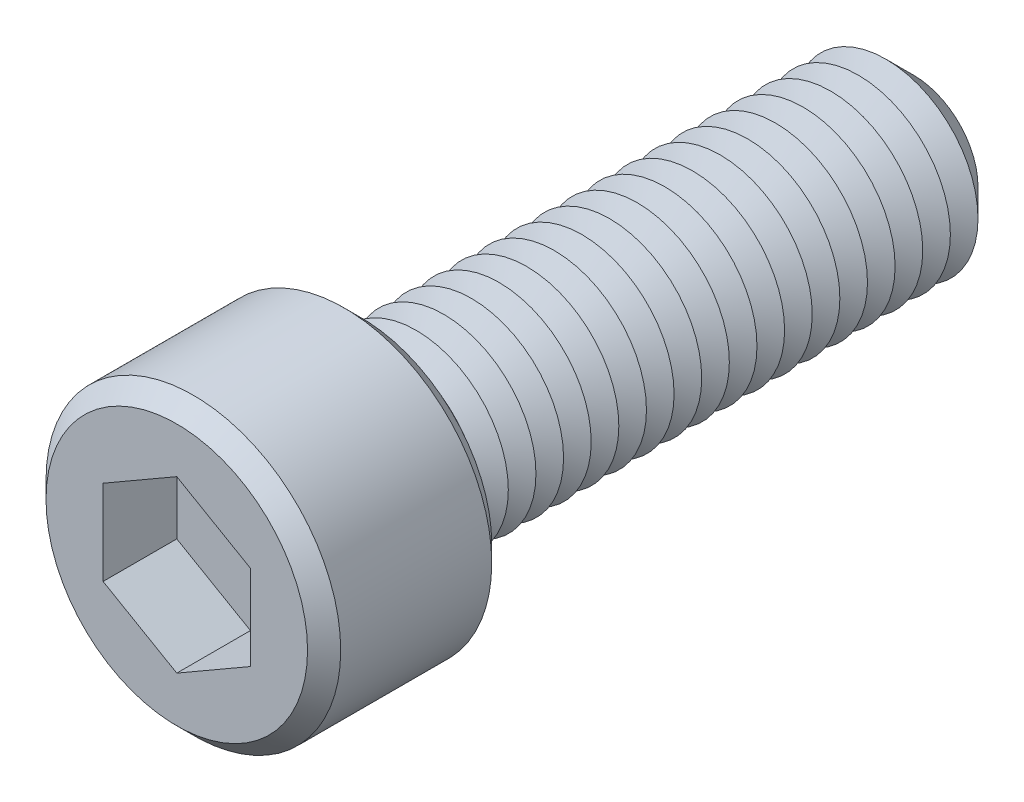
ISO-10303-21;
HEADER;
FILE_DESCRIPTION(('STEP AP214'),'2;1');
FILE_NAME('part.step','',(''),(''),'','','');
FILE_SCHEMA(('AUTOMOTIVE_DESIGN { 1 0 10303 214 1 1 1 1 }'));
ENDSEC;
DATA;
#1=APPLICATION_CONTEXT('core data for automotive mechanical design processes');
#2=APPLICATION_PROTOCOL_DEFINITION('international standard','automotive_design',2000,#1);
#3=PRODUCT_CONTEXT('',#1,'mechanical');
#4=PRODUCT('Part','Part','',(#3));
#5=PRODUCT_RELATED_PRODUCT_CATEGORY('part','',(#4));
#6=PRODUCT_DEFINITION_FORMATION('','',#4);
#7=PRODUCT_DEFINITION_CONTEXT('part definition',#1,'design');
#8=PRODUCT_DEFINITION('design','',#6,#7);
#9=PRODUCT_DEFINITION_SHAPE('','',#8);
#10=(LENGTH_UNIT() NAMED_UNIT(*) SI_UNIT(.MILLI.,.METRE.));
#11=(NAMED_UNIT(*) PLANE_ANGLE_UNIT() SI_UNIT($,.RADIAN.));
#12=(NAMED_UNIT(*) SI_UNIT($,.STERADIAN.) SOLID_ANGLE_UNIT());
#13=UNCERTAINTY_MEASURE_WITH_UNIT(LENGTH_MEASURE(1.E-05),#10,'distance_accuracy_value','');
#14=(GEOMETRIC_REPRESENTATION_CONTEXT(3) GLOBAL_UNCERTAINTY_ASSIGNED_CONTEXT((#13)) GLOBAL_UNIT_ASSIGNED_CONTEXT((#10,
#11,#12)) REPRESENTATION_CONTEXT('',''));
#15=CARTESIAN_POINT('',(0.,0.,0.));
#16=DIRECTION('',(0.,0.,1.));
#17=DIRECTION('',(1.,0.,0.));
#18=AXIS2_PLACEMENT_3D('',#15,#16,#17);
#19=CARTESIAN_POINT('',(0.,0.,10.));
#20=DIRECTION('',(0.,0.,-1.));
#21=DIRECTION('',(-1.,0.,0.));
#22=AXIS2_PLACEMENT_3D('',#19,#20,#21);
#23=CYLINDRICAL_SURFACE('',#22,8.);
#24=CARTESIAN_POINT('',(0.,0.,0.900000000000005));
#25=DIRECTION('',(0.,0.,1.));
#26=DIRECTION('',(1.,0.,0.));
#27=AXIS2_PLACEMENT_3D('',#24,#25,#26);
#28=CIRCLE('',#27,8.);
#29=CARTESIAN_POINT('',(8.,0.,0.900000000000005));
#30=VERTEX_POINT('',#29);
#31=EDGE_CURVE('E329',#30,#30,#28,.T.);
#32=ORIENTED_EDGE('',*,*,#31,.T.);
#33=EDGE_LOOP('',(#32));
#34=FACE_BOUND('',#33,.T.);
#35=CARTESIAN_POINT('',(0.,0.,9.1));
#36=DIRECTION('',(0.,0.,1.));
#37=DIRECTION('',(1.,0.,0.));
#38=AXIS2_PLACEMENT_3D('',#35,#36,#37);
#39=CIRCLE('',#38,8.);
#40=CARTESIAN_POINT('',(8.,0.,9.1));
#41=VERTEX_POINT('',#40);
#42=EDGE_CURVE('E325',#41,#41,#39,.F.);
#43=ORIENTED_EDGE('',*,*,#42,.T.);
#44=EDGE_LOOP('',(#43));
#45=FACE_BOUND('',#44,.T.);
#46=ADVANCED_FACE('F39',(#34,#45),#23,.T.);
#47=CARTESIAN_POINT('',(0.,0.,10.));
#48=DIRECTION('',(0.,0.,1.));
#49=DIRECTION('',(1.,0.,0.));
#50=AXIS2_PLACEMENT_3D('',#47,#48,#49);
#51=PLANE('',#50);
#52=CARTESIAN_POINT('',(0.,0.,10.));
#53=DIRECTION('',(0.,0.,1.));
#54=DIRECTION('',(1.,0.,0.));
#55=AXIS2_PLACEMENT_3D('',#52,#53,#54);
#56=CIRCLE('',#55,7.1);
#57=CARTESIAN_POINT('',(7.1,0.,10.));
#58=VERTEX_POINT('',#57);
#59=EDGE_CURVE('E11',#58,#58,#56,.T.);
#60=ORIENTED_EDGE('',*,*,#59,.T.);
#61=EDGE_LOOP('',(#60));
#62=FACE_BOUND('',#61,.T.);
#63=DIRECTION('',(-0.866025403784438,0.5,0.));
#64=VECTOR('',#63,1.);
#65=CARTESIAN_POINT('',(4.,2.3094010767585,10.));
#66=LINE('',#65,#64);
#67=CARTESIAN_POINT('',(4.,2.3094010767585,10.));
#68=VERTEX_POINT('',#67);
#69=CARTESIAN_POINT('',(0.,4.61880215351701,10.));
#70=VERTEX_POINT('',#69);
#71=EDGE_CURVE('E55',#68,#70,#66,.T.);
#72=ORIENTED_EDGE('',*,*,#71,.F.);
#73=DIRECTION('',(0.,1.,0.));
#74=VECTOR('',#73,1.);
#75=CARTESIAN_POINT('',(4.,-2.30940107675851,10.));
#76=LINE('',#75,#74);
#77=CARTESIAN_POINT('',(4.,-2.30940107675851,10.));
#78=VERTEX_POINT('',#77);
#79=EDGE_CURVE('E151',#78,#68,#76,.T.);
#80=ORIENTED_EDGE('',*,*,#79,.F.);
#81=DIRECTION('',(0.866025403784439,0.5,0.));
#82=VECTOR('',#81,1.);
#83=CARTESIAN_POINT('',(0.,-4.61880215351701,10.));
#84=LINE('',#83,#82);
#85=CARTESIAN_POINT('',(0.,-4.61880215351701,10.));
#86=VERTEX_POINT('',#85);
#87=EDGE_CURVE('E148',#86,#78,#84,.T.);
#88=ORIENTED_EDGE('',*,*,#87,.F.);
#89=DIRECTION('',(0.866025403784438,-0.5,0.));
#90=VECTOR('',#89,1.);
#91=CARTESIAN_POINT('',(-4.,-2.3094010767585,10.));
#92=LINE('',#91,#90);
#93=CARTESIAN_POINT('',(-4.,-2.3094010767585,10.));
#94=VERTEX_POINT('',#93);
#95=EDGE_CURVE('E103',#94,#86,#92,.T.);
#96=ORIENTED_EDGE('',*,*,#95,.F.);
#97=DIRECTION('',(0.,-1.,0.));
#98=VECTOR('',#97,1.);
#99=CARTESIAN_POINT('',(-4.,2.3094010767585,10.));
#100=LINE('',#99,#98);
#101=CARTESIAN_POINT('',(-4.,2.3094010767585,10.));
#102=VERTEX_POINT('',#101);
#103=EDGE_CURVE('E142',#102,#94,#100,.T.);
#104=ORIENTED_EDGE('',*,*,#103,.F.);
#105=DIRECTION('',(-0.866025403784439,-0.5,0.));
#106=VECTOR('',#105,1.);
#107=CARTESIAN_POINT('',(0.,4.61880215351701,10.));
#108=LINE('',#107,#106);
#109=EDGE_CURVE('E137',#70,#102,#108,.T.);
#110=ORIENTED_EDGE('',*,*,#109,.F.);
#111=EDGE_LOOP('',(#72,#80,#88,#96,#104,#110));
#112=FACE_BOUND('',#111,.T.);
#113=ADVANCED_FACE('F347',(#62,#112),#51,.T.);
#114=CARTESIAN_POINT('',(0.,0.,0.));
#115=DIRECTION('',(0.,0.,1.));
#116=DIRECTION('',(1.,0.,0.));
#117=AXIS2_PLACEMENT_3D('',#114,#115,#116);
#118=PLANE('',#117);
#119=CARTESIAN_POINT('',(0.,0.,0.));
#120=DIRECTION('',(0.,0.,1.));
#121=DIRECTION('',(1.,0.,0.));
#122=AXIS2_PLACEMENT_3D('',#119,#120,#121);
#123=CIRCLE('',#122,7.09999999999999);
#124=CARTESIAN_POINT('',(7.09999999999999,0.,0.));
#125=VERTEX_POINT('',#124);
#126=EDGE_CURVE('E48',#125,#125,#123,.F.);
#127=ORIENTED_EDGE('',*,*,#126,.T.);
#128=EDGE_LOOP('',(#127));
#129=FACE_BOUND('',#128,.T.);
#130=CARTESIAN_POINT('',(0.,0.,0.));
#131=DIRECTION('',(0.,0.,1.));
#132=DIRECTION('',(1.,0.,0.));
#133=AXIS2_PLACEMENT_3D('',#130,#131,#132);
#134=CIRCLE('',#133,5.);
#135=CARTESIAN_POINT('',(5.,0.,0.));
#136=VERTEX_POINT('',#135);
#137=EDGE_CURVE('E317',#136,#136,#134,.T.);
#138=ORIENTED_EDGE('',*,*,#137,.T.);
#139=EDGE_LOOP('',(#138));
#140=FACE_BOUND('',#139,.T.);
#141=ADVANCED_FACE('F336',(#129,#140),#118,.F.);
#142=CARTESIAN_POINT('',(0.,0.,0.));
#143=DIRECTION('',(0.,0.,1.));
#144=DIRECTION('',(1.,0.,0.));
#145=AXIS2_PLACEMENT_3D('',#142,#143,#144);
#146=CONICAL_SURFACE('',#145,5.,1.0471975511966);
#147=CARTESIAN_POINT('',(0.,0.,-0.750000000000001));
#148=DIRECTION('',(0.,0.,1.));
#149=DIRECTION('',(1.,0.,0.));
#150=AXIS2_PLACEMENT_3D('',#147,#148,#149);
#151=CIRCLE('',#150,3.70096189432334);
#152=CARTESIAN_POINT('',(3.70096189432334,0.,-0.750000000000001));
#153=VERTEX_POINT('',#152);
#154=EDGE_CURVE('E313',#153,#153,#151,.T.);
#155=ORIENTED_EDGE('',*,*,#154,.T.);
#156=EDGE_LOOP('',(#155));
#157=FACE_BOUND('',#156,.T.);
#158=ORIENTED_EDGE('',*,*,#137,.F.);
#159=EDGE_LOOP('',(#158));
#160=FACE_BOUND('',#159,.T.);
#161=ADVANCED_FACE('F548',(#157,#160),#146,.T.);
#162=CARTESIAN_POINT('',(0.,0.,-0.750000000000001));
#163=DIRECTION('',(0.,0.,-1.));
#164=DIRECTION('',(-1.,0.,0.));
#165=AXIS2_PLACEMENT_3D('',#162,#163,#164);
#166=CONICAL_SURFACE('',#165,3.70096189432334,1.0471975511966);
#167=CARTESIAN_POINT('',(0.,0.,-1.5));
#168=DIRECTION('',(0.,0.,1.));
#169=DIRECTION('',(1.,0.,0.));
#170=AXIS2_PLACEMENT_3D('',#167,#168,#169);
#171=CIRCLE('',#170,5.);
#172=CARTESIAN_POINT('',(5.,0.,-1.5));
#173=VERTEX_POINT('',#172);
#174=EDGE_CURVE('E309',#173,#173,#171,.T.);
#175=ORIENTED_EDGE('',*,*,#174,.T.);
#176=EDGE_LOOP('',(#175));
#177=FACE_BOUND('',#176,.T.);
#178=ORIENTED_EDGE('',*,*,#154,.F.);
#179=EDGE_LOOP('',(#178));
#180=FACE_BOUND('',#179,.T.);
#181=ADVANCED_FACE('F544',(#177,#180),#166,.T.);
#182=CARTESIAN_POINT('',(0.,0.,-1.5));
#183=DIRECTION('',(0.,0.,1.));
#184=DIRECTION('',(1.,0.,0.));
#185=AXIS2_PLACEMENT_3D('',#182,#183,#184);
#186=CONICAL_SURFACE('',#185,5.,1.0471975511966);
#187=CARTESIAN_POINT('',(0.,0.,-2.25));
#188=DIRECTION('',(0.,0.,1.));
#189=DIRECTION('',(1.,0.,0.));
#190=AXIS2_PLACEMENT_3D('',#187,#188,#189);
#191=CIRCLE('',#190,3.70096189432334);
#192=CARTESIAN_POINT('',(3.70096189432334,0.,-2.25));
#193=VERTEX_POINT('',#192);
#194=EDGE_CURVE('E305',#193,#193,#191,.T.);
#195=ORIENTED_EDGE('',*,*,#194,.T.);
#196=EDGE_LOOP('',(#195));
#197=FACE_BOUND('',#196,.T.);
#198=ORIENTED_EDGE('',*,*,#174,.F.);
#199=EDGE_LOOP('',(#198));
#200=FACE_BOUND('',#199,.T.);
#201=ADVANCED_FACE('F540',(#197,#200),#186,.T.);
#202=CARTESIAN_POINT('',(0.,0.,-2.25));
#203=DIRECTION('',(0.,0.,-1.));
#204=DIRECTION('',(-1.,0.,0.));
#205=AXIS2_PLACEMENT_3D('',#202,#203,#204);
#206=CONICAL_SURFACE('',#205,3.70096189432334,1.0471975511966);
#207=CARTESIAN_POINT('',(0.,0.,-3.));
#208=DIRECTION('',(0.,0.,1.));
#209=DIRECTION('',(1.,0.,0.));
#210=AXIS2_PLACEMENT_3D('',#207,#208,#209);
#211=CIRCLE('',#210,5.);
#212=CARTESIAN_POINT('',(5.,0.,-3.));
#213=VERTEX_POINT('',#212);
#214=EDGE_CURVE('E301',#213,#213,#211,.T.);
#215=ORIENTED_EDGE('',*,*,#214,.T.);
#216=EDGE_LOOP('',(#215));
#217=FACE_BOUND('',#216,.T.);
#218=ORIENTED_EDGE('',*,*,#194,.F.);
#219=EDGE_LOOP('',(#218));
#220=FACE_BOUND('',#219,.T.);
#221=ADVANCED_FACE('F536',(#217,#220),#206,.T.);
#222=CARTESIAN_POINT('',(0.,0.,-3.));
#223=DIRECTION('',(0.,0.,1.));
#224=DIRECTION('',(1.,0.,0.));
#225=AXIS2_PLACEMENT_3D('',#222,#223,#224);
#226=CONICAL_SURFACE('',#225,5.,1.0471975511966);
#227=CARTESIAN_POINT('',(0.,0.,-3.75));
#228=DIRECTION('',(0.,0.,1.));
#229=DIRECTION('',(1.,0.,0.));
#230=AXIS2_PLACEMENT_3D('',#227,#228,#229);
#231=CIRCLE('',#230,3.70096189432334);
#232=CARTESIAN_POINT('',(3.70096189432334,0.,-3.75));
#233=VERTEX_POINT('',#232);
#234=EDGE_CURVE('E297',#233,#233,#231,.T.);
#235=ORIENTED_EDGE('',*,*,#234,.T.);
#236=EDGE_LOOP('',(#235));
#237=FACE_BOUND('',#236,.T.);
#238=ORIENTED_EDGE('',*,*,#214,.F.);
#239=EDGE_LOOP('',(#238));
#240=FACE_BOUND('',#239,.T.);
#241=ADVANCED_FACE('F532',(#237,#240),#226,.T.);
#242=CARTESIAN_POINT('',(0.,0.,-3.75));
#243=DIRECTION('',(0.,0.,-1.));
#244=DIRECTION('',(-1.,0.,0.));
#245=AXIS2_PLACEMENT_3D('',#242,#243,#244);
#246=CONICAL_SURFACE('',#245,3.70096189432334,1.0471975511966);
#247=CARTESIAN_POINT('',(0.,0.,-4.5));
#248=DIRECTION('',(0.,0.,1.));
#249=DIRECTION('',(1.,0.,0.));
#250=AXIS2_PLACEMENT_3D('',#247,#248,#249);
#251=CIRCLE('',#250,5.);
#252=CARTESIAN_POINT('',(5.,0.,-4.5));
#253=VERTEX_POINT('',#252);
#254=EDGE_CURVE('E293',#253,#253,#251,.T.);
#255=ORIENTED_EDGE('',*,*,#254,.T.);
#256=EDGE_LOOP('',(#255));
#257=FACE_BOUND('',#256,.T.);
#258=ORIENTED_EDGE('',*,*,#234,.F.);
#259=EDGE_LOOP('',(#258));
#260=FACE_BOUND('',#259,.T.);
#261=ADVANCED_FACE('F528',(#257,#260),#246,.T.);
#262=CARTESIAN_POINT('',(0.,0.,-4.5));
#263=DIRECTION('',(0.,0.,1.));
#264=DIRECTION('',(1.,0.,0.));
#265=AXIS2_PLACEMENT_3D('',#262,#263,#264);
#266=CONICAL_SURFACE('',#265,5.,1.0471975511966);
#267=CARTESIAN_POINT('',(0.,0.,-5.25));
#268=DIRECTION('',(0.,0.,1.));
#269=DIRECTION('',(1.,0.,0.));
#270=AXIS2_PLACEMENT_3D('',#267,#268,#269);
#271=CIRCLE('',#270,3.70096189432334);
#272=CARTESIAN_POINT('',(3.70096189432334,0.,-5.25));
#273=VERTEX_POINT('',#272);
#274=EDGE_CURVE('E289',#273,#273,#271,.T.);
#275=ORIENTED_EDGE('',*,*,#274,.T.);
#276=EDGE_LOOP('',(#275));
#277=FACE_BOUND('',#276,.T.);
#278=ORIENTED_EDGE('',*,*,#254,.F.);
#279=EDGE_LOOP('',(#278));
#280=FACE_BOUND('',#279,.T.);
#281=ADVANCED_FACE('F524',(#277,#280),#266,.T.);
#282=CARTESIAN_POINT('',(0.,0.,-5.25));
#283=DIRECTION('',(0.,0.,-1.));
#284=DIRECTION('',(-1.,0.,0.));
#285=AXIS2_PLACEMENT_3D('',#282,#283,#284);
#286=CONICAL_SURFACE('',#285,3.70096189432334,1.0471975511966);
#287=CARTESIAN_POINT('',(0.,0.,-6.));
#288=DIRECTION('',(0.,0.,1.));
#289=DIRECTION('',(1.,0.,0.));
#290=AXIS2_PLACEMENT_3D('',#287,#288,#289);
#291=CIRCLE('',#290,5.);
#292=CARTESIAN_POINT('',(5.,0.,-6.));
#293=VERTEX_POINT('',#292);
#294=EDGE_CURVE('E285',#293,#293,#291,.T.);
#295=ORIENTED_EDGE('',*,*,#294,.T.);
#296=EDGE_LOOP('',(#295));
#297=FACE_BOUND('',#296,.T.);
#298=ORIENTED_EDGE('',*,*,#274,.F.);
#299=EDGE_LOOP('',(#298));
#300=FACE_BOUND('',#299,.T.);
#301=ADVANCED_FACE('F520',(#297,#300),#286,.T.);
#302=CARTESIAN_POINT('',(0.,0.,-6.));
#303=DIRECTION('',(0.,0.,1.));
#304=DIRECTION('',(1.,0.,0.));
#305=AXIS2_PLACEMENT_3D('',#302,#303,#304);
#306=CONICAL_SURFACE('',#305,5.,1.0471975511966);
#307=CARTESIAN_POINT('',(0.,0.,-6.75));
#308=DIRECTION('',(0.,0.,1.));
#309=DIRECTION('',(1.,0.,0.));
#310=AXIS2_PLACEMENT_3D('',#307,#308,#309);
#311=CIRCLE('',#310,3.70096189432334);
#312=CARTESIAN_POINT('',(3.70096189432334,0.,-6.75));
#313=VERTEX_POINT('',#312);
#314=EDGE_CURVE('E281',#313,#313,#311,.T.);
#315=ORIENTED_EDGE('',*,*,#314,.T.);
#316=EDGE_LOOP('',(#315));
#317=FACE_BOUND('',#316,.T.);
#318=ORIENTED_EDGE('',*,*,#294,.F.);
#319=EDGE_LOOP('',(#318));
#320=FACE_BOUND('',#319,.T.);
#321=ADVANCED_FACE('F516',(#317,#320),#306,.T.);
#322=CARTESIAN_POINT('',(0.,0.,-6.75));
#323=DIRECTION('',(0.,0.,-1.));
#324=DIRECTION('',(-1.,0.,0.));
#325=AXIS2_PLACEMENT_3D('',#322,#323,#324);
#326=CONICAL_SURFACE('',#325,3.70096189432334,1.0471975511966);
#327=CARTESIAN_POINT('',(0.,0.,-7.5));
#328=DIRECTION('',(0.,0.,1.));
#329=DIRECTION('',(1.,0.,0.));
#330=AXIS2_PLACEMENT_3D('',#327,#328,#329);
#331=CIRCLE('',#330,5.);
#332=CARTESIAN_POINT('',(5.,0.,-7.5));
#333=VERTEX_POINT('',#332);
#334=EDGE_CURVE('E277',#333,#333,#331,.T.);
#335=ORIENTED_EDGE('',*,*,#334,.T.);
#336=EDGE_LOOP('',(#335));
#337=FACE_BOUND('',#336,.T.);
#338=ORIENTED_EDGE('',*,*,#314,.F.);
#339=EDGE_LOOP('',(#338));
#340=FACE_BOUND('',#339,.T.);
#341=ADVANCED_FACE('F512',(#337,#340),#326,.T.);
#342=CARTESIAN_POINT('',(0.,0.,-7.5));
#343=DIRECTION('',(0.,0.,1.));
#344=DIRECTION('',(1.,0.,0.));
#345=AXIS2_PLACEMENT_3D('',#342,#343,#344);
#346=CONICAL_SURFACE('',#345,5.,1.0471975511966);
#347=CARTESIAN_POINT('',(0.,0.,-8.25));
#348=DIRECTION('',(0.,0.,1.));
#349=DIRECTION('',(1.,0.,0.));
#350=AXIS2_PLACEMENT_3D('',#347,#348,#349);
#351=CIRCLE('',#350,3.70096189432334);
#352=CARTESIAN_POINT('',(3.70096189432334,0.,-8.25));
#353=VERTEX_POINT('',#352);
#354=EDGE_CURVE('E273',#353,#353,#351,.T.);
#355=ORIENTED_EDGE('',*,*,#354,.T.);
#356=EDGE_LOOP('',(#355));
#357=FACE_BOUND('',#356,.T.);
#358=ORIENTED_EDGE('',*,*,#334,.F.);
#359=EDGE_LOOP('',(#358));
#360=FACE_BOUND('',#359,.T.);
#361=ADVANCED_FACE('F508',(#357,#360),#346,.T.);
#362=CARTESIAN_POINT('',(0.,0.,-8.25));
#363=DIRECTION('',(0.,0.,-1.));
#364=DIRECTION('',(-1.,0.,0.));
#365=AXIS2_PLACEMENT_3D('',#362,#363,#364);
#366=CONICAL_SURFACE('',#365,3.70096189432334,1.0471975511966);
#367=CARTESIAN_POINT('',(0.,0.,-9.));
#368=DIRECTION('',(0.,0.,1.));
#369=DIRECTION('',(1.,0.,0.));
#370=AXIS2_PLACEMENT_3D('',#367,#368,#369);
#371=CIRCLE('',#370,5.);
#372=CARTESIAN_POINT('',(5.,0.,-9.));
#373=VERTEX_POINT('',#372);
#374=EDGE_CURVE('E269',#373,#373,#371,.T.);
#375=ORIENTED_EDGE('',*,*,#374,.T.);
#376=EDGE_LOOP('',(#375));
#377=FACE_BOUND('',#376,.T.);
#378=ORIENTED_EDGE('',*,*,#354,.F.);
#379=EDGE_LOOP('',(#378));
#380=FACE_BOUND('',#379,.T.);
#381=ADVANCED_FACE('F504',(#377,#380),#366,.T.);
#382=CARTESIAN_POINT('',(0.,0.,-9.));
#383=DIRECTION('',(0.,0.,1.));
#384=DIRECTION('',(1.,0.,0.));
#385=AXIS2_PLACEMENT_3D('',#382,#383,#384);
#386=CONICAL_SURFACE('',#385,5.,1.0471975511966);
#387=CARTESIAN_POINT('',(0.,0.,-9.75));
#388=DIRECTION('',(0.,0.,1.));
#389=DIRECTION('',(1.,0.,0.));
#390=AXIS2_PLACEMENT_3D('',#387,#388,#389);
#391=CIRCLE('',#390,3.70096189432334);
#392=CARTESIAN_POINT('',(3.70096189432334,0.,-9.75));
#393=VERTEX_POINT('',#392);
#394=EDGE_CURVE('E265',#393,#393,#391,.T.);
#395=ORIENTED_EDGE('',*,*,#394,.T.);
#396=EDGE_LOOP('',(#395));
#397=FACE_BOUND('',#396,.T.);
#398=ORIENTED_EDGE('',*,*,#374,.F.);
#399=EDGE_LOOP('',(#398));
#400=FACE_BOUND('',#399,.T.);
#401=ADVANCED_FACE('F500',(#397,#400),#386,.T.);
#402=CARTESIAN_POINT('',(0.,0.,-9.75));
#403=DIRECTION('',(0.,0.,-1.));
#404=DIRECTION('',(-1.,0.,0.));
#405=AXIS2_PLACEMENT_3D('',#402,#403,#404);
#406=CONICAL_SURFACE('',#405,3.70096189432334,1.0471975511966);
#407=CARTESIAN_POINT('',(0.,0.,-10.5));
#408=DIRECTION('',(0.,0.,1.));
#409=DIRECTION('',(1.,0.,0.));
#410=AXIS2_PLACEMENT_3D('',#407,#408,#409);
#411=CIRCLE('',#410,5.);
#412=CARTESIAN_POINT('',(5.,0.,-10.5));
#413=VERTEX_POINT('',#412);
#414=EDGE_CURVE('E261',#413,#413,#411,.T.);
#415=ORIENTED_EDGE('',*,*,#414,.T.);
#416=EDGE_LOOP('',(#415));
#417=FACE_BOUND('',#416,.T.);
#418=ORIENTED_EDGE('',*,*,#394,.F.);
#419=EDGE_LOOP('',(#418));
#420=FACE_BOUND('',#419,.T.);
#421=ADVANCED_FACE('F496',(#417,#420),#406,.T.);
#422=CARTESIAN_POINT('',(0.,0.,-10.5));
#423=DIRECTION('',(0.,0.,1.));
#424=DIRECTION('',(1.,0.,0.));
#425=AXIS2_PLACEMENT_3D('',#422,#423,#424);
#426=CONICAL_SURFACE('',#425,5.,1.0471975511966);
#427=CARTESIAN_POINT('',(0.,0.,-11.25));
#428=DIRECTION('',(0.,0.,1.));
#429=DIRECTION('',(1.,0.,0.));
#430=AXIS2_PLACEMENT_3D('',#427,#428,#429);
#431=CIRCLE('',#430,3.70096189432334);
#432=CARTESIAN_POINT('',(3.70096189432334,0.,-11.25));
#433=VERTEX_POINT('',#432);
#434=EDGE_CURVE('E257',#433,#433,#431,.T.);
#435=ORIENTED_EDGE('',*,*,#434,.T.);
#436=EDGE_LOOP('',(#435));
#437=FACE_BOUND('',#436,.T.);
#438=ORIENTED_EDGE('',*,*,#414,.F.);
#439=EDGE_LOOP('',(#438));
#440=FACE_BOUND('',#439,.T.);
#441=ADVANCED_FACE('F492',(#437,#440),#426,.T.);
#442=CARTESIAN_POINT('',(0.,0.,-11.25));
#443=DIRECTION('',(0.,0.,-1.));
#444=DIRECTION('',(-1.,0.,0.));
#445=AXIS2_PLACEMENT_3D('',#442,#443,#444);
#446=CONICAL_SURFACE('',#445,3.70096189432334,1.0471975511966);
#447=CARTESIAN_POINT('',(0.,0.,-12.));
#448=DIRECTION('',(0.,0.,1.));
#449=DIRECTION('',(1.,0.,0.));
#450=AXIS2_PLACEMENT_3D('',#447,#448,#449);
#451=CIRCLE('',#450,5.);
#452=CARTESIAN_POINT('',(5.,0.,-12.));
#453=VERTEX_POINT('',#452);
#454=EDGE_CURVE('E253',#453,#453,#451,.T.);
#455=ORIENTED_EDGE('',*,*,#454,.T.);
#456=EDGE_LOOP('',(#455));
#457=FACE_BOUND('',#456,.T.);
#458=ORIENTED_EDGE('',*,*,#434,.F.);
#459=EDGE_LOOP('',(#458));
#460=FACE_BOUND('',#459,.T.);
#461=ADVANCED_FACE('F488',(#457,#460),#446,.T.);
#462=CARTESIAN_POINT('',(0.,0.,-12.));
#463=DIRECTION('',(0.,0.,1.));
#464=DIRECTION('',(1.,0.,0.));
#465=AXIS2_PLACEMENT_3D('',#462,#463,#464);
#466=CONICAL_SURFACE('',#465,5.,1.0471975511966);
#467=CARTESIAN_POINT('',(0.,0.,-12.75));
#468=DIRECTION('',(0.,0.,1.));
#469=DIRECTION('',(1.,0.,0.));
#470=AXIS2_PLACEMENT_3D('',#467,#468,#469);
#471=CIRCLE('',#470,3.70096189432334);
#472=CARTESIAN_POINT('',(3.70096189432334,0.,-12.75));
#473=VERTEX_POINT('',#472);
#474=EDGE_CURVE('E249',#473,#473,#471,.T.);
#475=ORIENTED_EDGE('',*,*,#474,.T.);
#476=EDGE_LOOP('',(#475));
#477=FACE_BOUND('',#476,.T.);
#478=ORIENTED_EDGE('',*,*,#454,.F.);
#479=EDGE_LOOP('',(#478));
#480=FACE_BOUND('',#479,.T.);
#481=ADVANCED_FACE('F484',(#477,#480),#466,.T.);
#482=CARTESIAN_POINT('',(0.,0.,-12.75));
#483=DIRECTION('',(0.,0.,-1.));
#484=DIRECTION('',(-1.,0.,0.));
#485=AXIS2_PLACEMENT_3D('',#482,#483,#484);
#486=CONICAL_SURFACE('',#485,3.70096189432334,1.0471975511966);
#487=CARTESIAN_POINT('',(0.,0.,-13.5));
#488=DIRECTION('',(0.,0.,1.));
#489=DIRECTION('',(1.,0.,0.));
#490=AXIS2_PLACEMENT_3D('',#487,#488,#489);
#491=CIRCLE('',#490,5.);
#492=CARTESIAN_POINT('',(5.,0.,-13.5));
#493=VERTEX_POINT('',#492);
#494=EDGE_CURVE('E245',#493,#493,#491,.T.);
#495=ORIENTED_EDGE('',*,*,#494,.T.);
#496=EDGE_LOOP('',(#495));
#497=FACE_BOUND('',#496,.T.);
#498=ORIENTED_EDGE('',*,*,#474,.F.);
#499=EDGE_LOOP('',(#498));
#500=FACE_BOUND('',#499,.T.);
#501=ADVANCED_FACE('F480',(#497,#500),#486,.T.);
#502=CARTESIAN_POINT('',(0.,0.,-13.5));
#503=DIRECTION('',(0.,0.,1.));
#504=DIRECTION('',(1.,0.,0.));
#505=AXIS2_PLACEMENT_3D('',#502,#503,#504);
#506=CONICAL_SURFACE('',#505,5.,1.0471975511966);
#507=CARTESIAN_POINT('',(0.,0.,-14.25));
#508=DIRECTION('',(0.,0.,1.));
#509=DIRECTION('',(1.,0.,0.));
#510=AXIS2_PLACEMENT_3D('',#507,#508,#509);
#511=CIRCLE('',#510,3.70096189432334);
#512=CARTESIAN_POINT('',(3.70096189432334,0.,-14.25));
#513=VERTEX_POINT('',#512);
#514=EDGE_CURVE('E241',#513,#513,#511,.T.);
#515=ORIENTED_EDGE('',*,*,#514,.T.);
#516=EDGE_LOOP('',(#515));
#517=FACE_BOUND('',#516,.T.);
#518=ORIENTED_EDGE('',*,*,#494,.F.);
#519=EDGE_LOOP('',(#518));
#520=FACE_BOUND('',#519,.T.);
#521=ADVANCED_FACE('F476',(#517,#520),#506,.T.);
#522=CARTESIAN_POINT('',(0.,0.,-14.25));
#523=DIRECTION('',(0.,0.,-1.));
#524=DIRECTION('',(-1.,0.,0.));
#525=AXIS2_PLACEMENT_3D('',#522,#523,#524);
#526=CONICAL_SURFACE('',#525,3.70096189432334,1.0471975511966);
#527=CARTESIAN_POINT('',(0.,0.,-15.));
#528=DIRECTION('',(0.,0.,1.));
#529=DIRECTION('',(1.,0.,0.));
#530=AXIS2_PLACEMENT_3D('',#527,#528,#529);
#531=CIRCLE('',#530,5.);
#532=CARTESIAN_POINT('',(5.,0.,-15.));
#533=VERTEX_POINT('',#532);
#534=EDGE_CURVE('E237',#533,#533,#531,.T.);
#535=ORIENTED_EDGE('',*,*,#534,.T.);
#536=EDGE_LOOP('',(#535));
#537=FACE_BOUND('',#536,.T.);
#538=ORIENTED_EDGE('',*,*,#514,.F.);
#539=EDGE_LOOP('',(#538));
#540=FACE_BOUND('',#539,.T.);
#541=ADVANCED_FACE('F472',(#537,#540),#526,.T.);
#542=CARTESIAN_POINT('',(0.,0.,-15.));
#543=DIRECTION('',(0.,0.,1.));
#544=DIRECTION('',(1.,0.,0.));
#545=AXIS2_PLACEMENT_3D('',#542,#543,#544);
#546=CONICAL_SURFACE('',#545,5.,1.0471975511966);
#547=CARTESIAN_POINT('',(0.,0.,-15.75));
#548=DIRECTION('',(0.,0.,1.));
#549=DIRECTION('',(1.,0.,0.));
#550=AXIS2_PLACEMENT_3D('',#547,#548,#549);
#551=CIRCLE('',#550,3.70096189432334);
#552=CARTESIAN_POINT('',(3.70096189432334,0.,-15.75));
#553=VERTEX_POINT('',#552);
#554=EDGE_CURVE('E233',#553,#553,#551,.T.);
#555=ORIENTED_EDGE('',*,*,#554,.T.);
#556=EDGE_LOOP('',(#555));
#557=FACE_BOUND('',#556,.T.);
#558=ORIENTED_EDGE('',*,*,#534,.F.);
#559=EDGE_LOOP('',(#558));
#560=FACE_BOUND('',#559,.T.);
#561=ADVANCED_FACE('F468',(#557,#560),#546,.T.);
#562=CARTESIAN_POINT('',(0.,0.,-15.75));
#563=DIRECTION('',(0.,0.,-1.));
#564=DIRECTION('',(-1.,0.,0.));
#565=AXIS2_PLACEMENT_3D('',#562,#563,#564);
#566=CONICAL_SURFACE('',#565,3.70096189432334,1.0471975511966);
#567=CARTESIAN_POINT('',(0.,0.,-16.5));
#568=DIRECTION('',(0.,0.,1.));
#569=DIRECTION('',(1.,0.,0.));
#570=AXIS2_PLACEMENT_3D('',#567,#568,#569);
#571=CIRCLE('',#570,5.);
#572=CARTESIAN_POINT('',(5.,0.,-16.5));
#573=VERTEX_POINT('',#572);
#574=EDGE_CURVE('E229',#573,#573,#571,.T.);
#575=ORIENTED_EDGE('',*,*,#574,.T.);
#576=EDGE_LOOP('',(#575));
#577=FACE_BOUND('',#576,.T.);
#578=ORIENTED_EDGE('',*,*,#554,.F.);
#579=EDGE_LOOP('',(#578));
#580=FACE_BOUND('',#579,.T.);
#581=ADVANCED_FACE('F464',(#577,#580),#566,.T.);
#582=CARTESIAN_POINT('',(0.,0.,-16.5));
#583=DIRECTION('',(0.,0.,1.));
#584=DIRECTION('',(1.,0.,0.));
#585=AXIS2_PLACEMENT_3D('',#582,#583,#584);
#586=CONICAL_SURFACE('',#585,5.,1.0471975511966);
#587=CARTESIAN_POINT('',(0.,0.,-17.25));
#588=DIRECTION('',(0.,0.,1.));
#589=DIRECTION('',(1.,0.,0.));
#590=AXIS2_PLACEMENT_3D('',#587,#588,#589);
#591=CIRCLE('',#590,3.70096189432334);
#592=CARTESIAN_POINT('',(3.70096189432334,0.,-17.25));
#593=VERTEX_POINT('',#592);
#594=EDGE_CURVE('E225',#593,#593,#591,.T.);
#595=ORIENTED_EDGE('',*,*,#594,.T.);
#596=EDGE_LOOP('',(#595));
#597=FACE_BOUND('',#596,.T.);
#598=ORIENTED_EDGE('',*,*,#574,.F.);
#599=EDGE_LOOP('',(#598));
#600=FACE_BOUND('',#599,.T.);
#601=ADVANCED_FACE('F460',(#597,#600),#586,.T.);
#602=CARTESIAN_POINT('',(0.,0.,-17.25));
#603=DIRECTION('',(0.,0.,-1.));
#604=DIRECTION('',(-1.,0.,0.));
#605=AXIS2_PLACEMENT_3D('',#602,#603,#604);
#606=CONICAL_SURFACE('',#605,3.70096189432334,1.0471975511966);
#607=CARTESIAN_POINT('',(0.,0.,-18.));
#608=DIRECTION('',(0.,0.,1.));
#609=DIRECTION('',(1.,0.,0.));
#610=AXIS2_PLACEMENT_3D('',#607,#608,#609);
#611=CIRCLE('',#610,5.);
#612=CARTESIAN_POINT('',(5.,0.,-18.));
#613=VERTEX_POINT('',#612);
#614=EDGE_CURVE('E221',#613,#613,#611,.T.);
#615=ORIENTED_EDGE('',*,*,#614,.T.);
#616=EDGE_LOOP('',(#615));
#617=FACE_BOUND('',#616,.T.);
#618=ORIENTED_EDGE('',*,*,#594,.F.);
#619=EDGE_LOOP('',(#618));
#620=FACE_BOUND('',#619,.T.);
#621=ADVANCED_FACE('F456',(#617,#620),#606,.T.);
#622=CARTESIAN_POINT('',(0.,0.,-18.));
#623=DIRECTION('',(0.,0.,1.));
#624=DIRECTION('',(1.,0.,0.));
#625=AXIS2_PLACEMENT_3D('',#622,#623,#624);
#626=CONICAL_SURFACE('',#625,5.,1.0471975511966);
#627=CARTESIAN_POINT('',(0.,0.,-18.75));
#628=DIRECTION('',(0.,0.,1.));
#629=DIRECTION('',(1.,0.,0.));
#630=AXIS2_PLACEMENT_3D('',#627,#628,#629);
#631=CIRCLE('',#630,3.70096189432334);
#632=CARTESIAN_POINT('',(3.70096189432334,0.,-18.75));
#633=VERTEX_POINT('',#632);
#634=EDGE_CURVE('E217',#633,#633,#631,.T.);
#635=ORIENTED_EDGE('',*,*,#634,.T.);
#636=EDGE_LOOP('',(#635));
#637=FACE_BOUND('',#636,.T.);
#638=ORIENTED_EDGE('',*,*,#614,.F.);
#639=EDGE_LOOP('',(#638));
#640=FACE_BOUND('',#639,.T.);
#641=ADVANCED_FACE('F452',(#637,#640),#626,.T.);
#642=CARTESIAN_POINT('',(0.,0.,-18.75));
#643=DIRECTION('',(0.,0.,-1.));
#644=DIRECTION('',(-1.,0.,0.));
#645=AXIS2_PLACEMENT_3D('',#642,#643,#644);
#646=CONICAL_SURFACE('',#645,3.70096189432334,1.0471975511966);
#647=CARTESIAN_POINT('',(0.,0.,-19.5));
#648=DIRECTION('',(0.,0.,1.));
#649=DIRECTION('',(1.,0.,0.));
#650=AXIS2_PLACEMENT_3D('',#647,#648,#649);
#651=CIRCLE('',#650,5.);
#652=CARTESIAN_POINT('',(5.,0.,-19.5));
#653=VERTEX_POINT('',#652);
#654=EDGE_CURVE('E213',#653,#653,#651,.T.);
#655=ORIENTED_EDGE('',*,*,#654,.T.);
#656=EDGE_LOOP('',(#655));
#657=FACE_BOUND('',#656,.T.);
#658=ORIENTED_EDGE('',*,*,#634,.F.);
#659=EDGE_LOOP('',(#658));
#660=FACE_BOUND('',#659,.T.);
#661=ADVANCED_FACE('F448',(#657,#660),#646,.T.);
#662=CARTESIAN_POINT('',(0.,0.,-19.5));
#663=DIRECTION('',(0.,0.,1.));
#664=DIRECTION('',(1.,0.,0.));
#665=AXIS2_PLACEMENT_3D('',#662,#663,#664);
#666=CONICAL_SURFACE('',#665,5.,1.0471975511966);
#667=CARTESIAN_POINT('',(0.,0.,-20.25));
#668=DIRECTION('',(0.,0.,1.));
#669=DIRECTION('',(1.,0.,0.));
#670=AXIS2_PLACEMENT_3D('',#667,#668,#669);
#671=CIRCLE('',#670,3.70096189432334);
#672=CARTESIAN_POINT('',(3.70096189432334,0.,-20.25));
#673=VERTEX_POINT('',#672);
#674=EDGE_CURVE('E209',#673,#673,#671,.T.);
#675=ORIENTED_EDGE('',*,*,#674,.T.);
#676=EDGE_LOOP('',(#675));
#677=FACE_BOUND('',#676,.T.);
#678=ORIENTED_EDGE('',*,*,#654,.F.);
#679=EDGE_LOOP('',(#678));
#680=FACE_BOUND('',#679,.T.);
#681=ADVANCED_FACE('F444',(#677,#680),#666,.T.);
#682=CARTESIAN_POINT('',(0.,0.,-20.25));
#683=DIRECTION('',(0.,0.,-1.));
#684=DIRECTION('',(-1.,0.,0.));
#685=AXIS2_PLACEMENT_3D('',#682,#683,#684);
#686=CONICAL_SURFACE('',#685,3.70096189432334,1.0471975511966);
#687=CARTESIAN_POINT('',(0.,0.,-21.));
#688=DIRECTION('',(0.,0.,1.));
#689=DIRECTION('',(1.,0.,0.));
#690=AXIS2_PLACEMENT_3D('',#687,#688,#689);
#691=CIRCLE('',#690,5.);
#692=CARTESIAN_POINT('',(5.,0.,-21.));
#693=VERTEX_POINT('',#692);
#694=EDGE_CURVE('E205',#693,#693,#691,.T.);
#695=ORIENTED_EDGE('',*,*,#694,.T.);
#696=EDGE_LOOP('',(#695));
#697=FACE_BOUND('',#696,.T.);
#698=ORIENTED_EDGE('',*,*,#674,.F.);
#699=EDGE_LOOP('',(#698));
#700=FACE_BOUND('',#699,.T.);
#701=ADVANCED_FACE('F440',(#697,#700),#686,.T.);
#702=CARTESIAN_POINT('',(0.,0.,-21.));
#703=DIRECTION('',(0.,0.,1.));
#704=DIRECTION('',(1.,0.,0.));
#705=AXIS2_PLACEMENT_3D('',#702,#703,#704);
#706=CONICAL_SURFACE('',#705,5.,1.0471975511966);
#707=CARTESIAN_POINT('',(0.,0.,-21.75));
#708=DIRECTION('',(0.,0.,1.));
#709=DIRECTION('',(1.,0.,0.));
#710=AXIS2_PLACEMENT_3D('',#707,#708,#709);
#711=CIRCLE('',#710,3.70096189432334);
#712=CARTESIAN_POINT('',(3.70096189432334,0.,-21.75));
#713=VERTEX_POINT('',#712);
#714=EDGE_CURVE('E201',#713,#713,#711,.T.);
#715=ORIENTED_EDGE('',*,*,#714,.T.);
#716=EDGE_LOOP('',(#715));
#717=FACE_BOUND('',#716,.T.);
#718=ORIENTED_EDGE('',*,*,#694,.F.);
#719=EDGE_LOOP('',(#718));
#720=FACE_BOUND('',#719,.T.);
#721=ADVANCED_FACE('F436',(#717,#720),#706,.T.);
#722=CARTESIAN_POINT('',(0.,0.,-21.75));
#723=DIRECTION('',(0.,0.,-1.));
#724=DIRECTION('',(-1.,0.,0.));
#725=AXIS2_PLACEMENT_3D('',#722,#723,#724);
#726=CONICAL_SURFACE('',#725,3.70096189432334,1.0471975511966);
#727=CARTESIAN_POINT('',(0.,0.,-22.5));
#728=DIRECTION('',(0.,0.,1.));
#729=DIRECTION('',(1.,0.,0.));
#730=AXIS2_PLACEMENT_3D('',#727,#728,#729);
#731=CIRCLE('',#730,5.);
#732=CARTESIAN_POINT('',(5.,0.,-22.5));
#733=VERTEX_POINT('',#732);
#734=EDGE_CURVE('E197',#733,#733,#731,.T.);
#735=ORIENTED_EDGE('',*,*,#734,.T.);
#736=EDGE_LOOP('',(#735));
#737=FACE_BOUND('',#736,.T.);
#738=ORIENTED_EDGE('',*,*,#714,.F.);
#739=EDGE_LOOP('',(#738));
#740=FACE_BOUND('',#739,.T.);
#741=ADVANCED_FACE('F432',(#737,#740),#726,.T.);
#742=CARTESIAN_POINT('',(0.,0.,-22.5));
#743=DIRECTION('',(0.,0.,1.));
#744=DIRECTION('',(1.,0.,0.));
#745=AXIS2_PLACEMENT_3D('',#742,#743,#744);
#746=CONICAL_SURFACE('',#745,5.,1.0471975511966);
#747=CARTESIAN_POINT('',(0.,0.,-23.25));
#748=DIRECTION('',(0.,0.,1.));
#749=DIRECTION('',(1.,0.,0.));
#750=AXIS2_PLACEMENT_3D('',#747,#748,#749);
#751=CIRCLE('',#750,3.70096189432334);
#752=CARTESIAN_POINT('',(3.70096189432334,0.,-23.25));
#753=VERTEX_POINT('',#752);
#754=EDGE_CURVE('E193',#753,#753,#751,.T.);
#755=ORIENTED_EDGE('',*,*,#754,.T.);
#756=EDGE_LOOP('',(#755));
#757=FACE_BOUND('',#756,.T.);
#758=ORIENTED_EDGE('',*,*,#734,.F.);
#759=EDGE_LOOP('',(#758));
#760=FACE_BOUND('',#759,.T.);
#761=ADVANCED_FACE('F428',(#757,#760),#746,.T.);
#762=CARTESIAN_POINT('',(0.,0.,-23.25));
#763=DIRECTION('',(0.,0.,-1.));
#764=DIRECTION('',(-1.,0.,0.));
#765=AXIS2_PLACEMENT_3D('',#762,#763,#764);
#766=CONICAL_SURFACE('',#765,3.70096189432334,1.0471975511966);
#767=CARTESIAN_POINT('',(0.,0.,-24.));
#768=DIRECTION('',(0.,0.,1.));
#769=DIRECTION('',(1.,0.,0.));
#770=AXIS2_PLACEMENT_3D('',#767,#768,#769);
#771=CIRCLE('',#770,5.);
#772=CARTESIAN_POINT('',(5.,0.,-24.));
#773=VERTEX_POINT('',#772);
#774=EDGE_CURVE('E189',#773,#773,#771,.T.);
#775=ORIENTED_EDGE('',*,*,#774,.T.);
#776=EDGE_LOOP('',(#775));
#777=FACE_BOUND('',#776,.T.);
#778=ORIENTED_EDGE('',*,*,#754,.F.);
#779=EDGE_LOOP('',(#778));
#780=FACE_BOUND('',#779,.T.);
#781=ADVANCED_FACE('F424',(#777,#780),#766,.T.);
#782=CARTESIAN_POINT('',(0.,0.,-24.));
#783=DIRECTION('',(0.,0.,1.));
#784=DIRECTION('',(1.,0.,0.));
#785=AXIS2_PLACEMENT_3D('',#782,#783,#784);
#786=CONICAL_SURFACE('',#785,5.,1.0471975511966);
#787=CARTESIAN_POINT('',(0.,0.,-24.75));
#788=DIRECTION('',(0.,0.,1.));
#789=DIRECTION('',(1.,0.,0.));
#790=AXIS2_PLACEMENT_3D('',#787,#788,#789);
#791=CIRCLE('',#790,3.70096189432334);
#792=CARTESIAN_POINT('',(3.70096189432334,0.,-24.75));
#793=VERTEX_POINT('',#792);
#794=EDGE_CURVE('E185',#793,#793,#791,.T.);
#795=ORIENTED_EDGE('',*,*,#794,.T.);
#796=EDGE_LOOP('',(#795));
#797=FACE_BOUND('',#796,.T.);
#798=ORIENTED_EDGE('',*,*,#774,.F.);
#799=EDGE_LOOP('',(#798));
#800=FACE_BOUND('',#799,.T.);
#801=ADVANCED_FACE('F420',(#797,#800),#786,.T.);
#802=CARTESIAN_POINT('',(0.,0.,-24.75));
#803=DIRECTION('',(0.,0.,-1.));
#804=DIRECTION('',(-1.,0.,0.));
#805=AXIS2_PLACEMENT_3D('',#802,#803,#804);
#806=CONICAL_SURFACE('',#805,3.70096189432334,1.0471975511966);
#807=CARTESIAN_POINT('',(0.,0.,-25.5));
#808=DIRECTION('',(0.,0.,1.));
#809=DIRECTION('',(1.,0.,0.));
#810=AXIS2_PLACEMENT_3D('',#807,#808,#809);
#811=CIRCLE('',#810,5.);
#812=CARTESIAN_POINT('',(5.,0.,-25.5));
#813=VERTEX_POINT('',#812);
#814=EDGE_CURVE('E181',#813,#813,#811,.T.);
#815=ORIENTED_EDGE('',*,*,#814,.T.);
#816=EDGE_LOOP('',(#815));
#817=FACE_BOUND('',#816,.T.);
#818=ORIENTED_EDGE('',*,*,#794,.F.);
#819=EDGE_LOOP('',(#818));
#820=FACE_BOUND('',#819,.T.);
#821=ADVANCED_FACE('F416',(#817,#820),#806,.T.);
#822=CARTESIAN_POINT('',(0.,0.,-25.5));
#823=DIRECTION('',(0.,0.,1.));
#824=DIRECTION('',(1.,0.,0.));
#825=AXIS2_PLACEMENT_3D('',#822,#823,#824);
#826=CONICAL_SURFACE('',#825,5.,1.0471975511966);
#827=CARTESIAN_POINT('',(0.,0.,-26.25));
#828=DIRECTION('',(0.,0.,1.));
#829=DIRECTION('',(1.,0.,0.));
#830=AXIS2_PLACEMENT_3D('',#827,#828,#829);
#831=CIRCLE('',#830,3.70096189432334);
#832=CARTESIAN_POINT('',(3.70096189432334,0.,-26.25));
#833=VERTEX_POINT('',#832);
#834=EDGE_CURVE('E177',#833,#833,#831,.T.);
#835=ORIENTED_EDGE('',*,*,#834,.T.);
#836=EDGE_LOOP('',(#835));
#837=FACE_BOUND('',#836,.T.);
#838=ORIENTED_EDGE('',*,*,#814,.F.);
#839=EDGE_LOOP('',(#838));
#840=FACE_BOUND('',#839,.T.);
#841=ADVANCED_FACE('F412',(#837,#840),#826,.T.);
#842=CARTESIAN_POINT('',(0.,0.,-26.25));
#843=DIRECTION('',(0.,0.,-1.));
#844=DIRECTION('',(-1.,0.,0.));
#845=AXIS2_PLACEMENT_3D('',#842,#843,#844);
#846=CONICAL_SURFACE('',#845,3.70096189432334,1.0471975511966);
#847=CARTESIAN_POINT('',(0.,0.,-27.));
#848=DIRECTION('',(0.,0.,1.));
#849=DIRECTION('',(1.,0.,0.));
#850=AXIS2_PLACEMENT_3D('',#847,#848,#849);
#851=CIRCLE('',#850,5.);
#852=CARTESIAN_POINT('',(5.,0.,-27.));
#853=VERTEX_POINT('',#852);
#854=EDGE_CURVE('E173',#853,#853,#851,.T.);
#855=ORIENTED_EDGE('',*,*,#854,.T.);
#856=EDGE_LOOP('',(#855));
#857=FACE_BOUND('',#856,.T.);
#858=ORIENTED_EDGE('',*,*,#834,.F.);
#859=EDGE_LOOP('',(#858));
#860=FACE_BOUND('',#859,.T.);
#861=ADVANCED_FACE('F408',(#857,#860),#846,.T.);
#862=CARTESIAN_POINT('',(0.,0.,-27.));
#863=DIRECTION('',(0.,0.,1.));
#864=DIRECTION('',(1.,0.,0.));
#865=AXIS2_PLACEMENT_3D('',#862,#863,#864);
#866=CONICAL_SURFACE('',#865,5.,1.0471975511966);
#867=CARTESIAN_POINT('',(0.,0.,-27.75));
#868=DIRECTION('',(0.,0.,1.));
#869=DIRECTION('',(1.,0.,0.));
#870=AXIS2_PLACEMENT_3D('',#867,#868,#869);
#871=CIRCLE('',#870,3.70096189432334);
#872=CARTESIAN_POINT('',(3.70096189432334,0.,-27.75));
#873=VERTEX_POINT('',#872);
#874=EDGE_CURVE('E169',#873,#873,#871,.T.);
#875=ORIENTED_EDGE('',*,*,#874,.T.);
#876=EDGE_LOOP('',(#875));
#877=FACE_BOUND('',#876,.T.);
#878=ORIENTED_EDGE('',*,*,#854,.F.);
#879=EDGE_LOOP('',(#878));
#880=FACE_BOUND('',#879,.T.);
#881=ADVANCED_FACE('F404',(#877,#880),#866,.T.);
#882=CARTESIAN_POINT('',(0.,0.,-27.75));
#883=DIRECTION('',(0.,0.,-1.));
#884=DIRECTION('',(-1.,0.,0.));
#885=AXIS2_PLACEMENT_3D('',#882,#883,#884);
#886=CONICAL_SURFACE('',#885,3.70096189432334,1.0471975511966);
#887=CARTESIAN_POINT('',(0.,0.,-28.5));
#888=DIRECTION('',(0.,0.,1.));
#889=DIRECTION('',(1.,0.,0.));
#890=AXIS2_PLACEMENT_3D('',#887,#888,#889);
#891=CIRCLE('',#890,5.);
#892=CARTESIAN_POINT('',(5.,0.,-28.5));
#893=VERTEX_POINT('',#892);
#894=EDGE_CURVE('E157',#893,#893,#891,.T.);
#895=ORIENTED_EDGE('',*,*,#894,.T.);
#896=EDGE_LOOP('',(#895));
#897=FACE_BOUND('',#896,.T.);
#898=ORIENTED_EDGE('',*,*,#874,.F.);
#899=EDGE_LOOP('',(#898));
#900=FACE_BOUND('',#899,.T.);
#901=ADVANCED_FACE('F400',(#897,#900),#886,.T.);
#902=CARTESIAN_POINT('',(0.,0.,-30.));
#903=DIRECTION('',(0.,0.,-1.));
#904=DIRECTION('',(-1.,0.,0.));
#905=AXIS2_PLACEMENT_3D('',#902,#903,#904);
#906=PLANE('',#905);
#907=CARTESIAN_POINT('',(0.,0.,-30.));
#908=DIRECTION('',(0.,0.,-1.));
#909=DIRECTION('',(-1.,0.,0.));
#910=AXIS2_PLACEMENT_3D('',#907,#908,#909);
#911=CIRCLE('',#910,0.9);
#912=CARTESIAN_POINT('',(-0.9,0.,-30.));
#913=VERTEX_POINT('',#912);
#914=EDGE_CURVE('E138',#913,#913,#911,.F.);
#915=ORIENTED_EDGE('',*,*,#914,.T.);
#916=EDGE_LOOP('',(#915));
#917=FACE_BOUND('',#916,.T.);
#918=CARTESIAN_POINT('',(0.,0.,-30.));
#919=DIRECTION('',(0.,0.,-1.));
#920=DIRECTION('',(-1.,0.,0.));
#921=AXIS2_PLACEMENT_3D('',#918,#919,#920);
#922=CIRCLE('',#921,3.5);
#923=CARTESIAN_POINT('',(-3.5,0.,-30.));
#924=VERTEX_POINT('',#923);
#925=EDGE_CURVE('E321',#924,#924,#922,.T.);
#926=ORIENTED_EDGE('',*,*,#925,.T.);
#927=EDGE_LOOP('',(#926));
#928=FACE_BOUND('',#927,.T.);
#929=ADVANCED_FACE('F403',(#917,#928),#906,.T.);
#930=CARTESIAN_POINT('',(0.,0.,-30.));
#931=DIRECTION('',(0.,0.,1.));
#932=DIRECTION('',(1.,0.,0.));
#933=AXIS2_PLACEMENT_3D('',#930,#931,#932);
#934=CONICAL_SURFACE('',#933,3.5,0.785398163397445);
#935=ORIENTED_EDGE('',*,*,#894,.F.);
#936=EDGE_LOOP('',(#935));
#937=FACE_BOUND('',#936,.T.);
#938=ORIENTED_EDGE('',*,*,#925,.F.);
#939=EDGE_LOOP('',(#938));
#940=FACE_BOUND('',#939,.T.);
#941=ADVANCED_FACE('F399',(#937,#940),#934,.T.);
#942=CARTESIAN_POINT('',(4.,2.3094010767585,6.));
#943=DIRECTION('',(0.5,0.866025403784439,0.));
#944=DIRECTION('',(-0.866025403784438,0.5,0.));
#945=AXIS2_PLACEMENT_3D('',#942,#943,#944);
#946=PLANE('',#945);
#947=ORIENTED_EDGE('',*,*,#71,.T.);
#948=DIRECTION('',(0.,0.,1.));
#949=VECTOR('',#948,1.);
#950=CARTESIAN_POINT('',(0.,4.61880215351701,6.));
#951=LINE('',#950,#949);
#952=CARTESIAN_POINT('',(0.,4.61880215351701,6.));
#953=VERTEX_POINT('',#952);
#954=EDGE_CURVE('E85',#953,#70,#951,.T.);
#955=ORIENTED_EDGE('',*,*,#954,.F.);
#956=DIRECTION('',(-0.866025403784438,0.5,0.));
#957=VECTOR('',#956,1.);
#958=CARTESIAN_POINT('',(4.,2.3094010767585,6.));
#959=LINE('',#958,#957);
#960=CARTESIAN_POINT('',(4.,2.3094010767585,6.));
#961=VERTEX_POINT('',#960);
#962=EDGE_CURVE('E154',#961,#953,#959,.T.);
#963=ORIENTED_EDGE('',*,*,#962,.F.);
#964=DIRECTION('',(0.,0.,1.));
#965=VECTOR('',#964,1.);
#966=CARTESIAN_POINT('',(4.,2.3094010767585,6.));
#967=LINE('',#966,#965);
#968=EDGE_CURVE('E63',#961,#68,#967,.T.);
#969=ORIENTED_EDGE('',*,*,#968,.T.);
#970=EDGE_LOOP('',(#947,#955,#963,#969));
#971=FACE_BOUND('',#970,.T.);
#972=ADVANCED_FACE('F389',(#971),#946,.F.);
#973=CARTESIAN_POINT('',(4.,-2.30940107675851,6.));
#974=DIRECTION('',(1.,0.,0.));
#975=DIRECTION('',(0.,0.,-1.));
#976=AXIS2_PLACEMENT_3D('',#973,#974,#975);
#977=PLANE('',#976);
#978=ORIENTED_EDGE('',*,*,#79,.T.);
#979=ORIENTED_EDGE('',*,*,#968,.F.);
#980=DIRECTION('',(0.,1.,0.));
#981=VECTOR('',#980,1.);
#982=CARTESIAN_POINT('',(4.,-2.30940107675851,6.));
#983=LINE('',#982,#981);
#984=CARTESIAN_POINT('',(4.,-2.30940107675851,6.));
#985=VERTEX_POINT('',#984);
#986=EDGE_CURVE('E117',#985,#961,#983,.T.);
#987=ORIENTED_EDGE('',*,*,#986,.F.);
#988=DIRECTION('',(0.,0.,1.));
#989=VECTOR('',#988,1.);
#990=CARTESIAN_POINT('',(4.,-2.30940107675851,6.));
#991=LINE('',#990,#989);
#992=EDGE_CURVE('E108',#985,#78,#991,.T.);
#993=ORIENTED_EDGE('',*,*,#992,.T.);
#994=EDGE_LOOP('',(#978,#979,#987,#993));
#995=FACE_BOUND('',#994,.T.);
#996=ADVANCED_FACE('F386',(#995),#977,.F.);
#997=CARTESIAN_POINT('',(0.,-4.61880215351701,6.));
#998=DIRECTION('',(0.5,-0.866025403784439,0.));
#999=DIRECTION('',(0.866025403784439,0.5,0.));
#1000=AXIS2_PLACEMENT_3D('',#997,#998,#999);
#1001=PLANE('',#1000);
#1002=ORIENTED_EDGE('',*,*,#87,.T.);
#1003=ORIENTED_EDGE('',*,*,#992,.F.);
#1004=DIRECTION('',(0.866025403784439,0.5,0.));
#1005=VECTOR('',#1004,1.);
#1006=CARTESIAN_POINT('',(0.,-4.61880215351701,6.));
#1007=LINE('',#1006,#1005);
#1008=CARTESIAN_POINT('',(0.,-4.61880215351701,6.));
#1009=VERTEX_POINT('',#1008);
#1010=EDGE_CURVE('E112',#1009,#985,#1007,.T.);
#1011=ORIENTED_EDGE('',*,*,#1010,.F.);
#1012=DIRECTION('',(0.,0.,1.));
#1013=VECTOR('',#1012,1.);
#1014=CARTESIAN_POINT('',(0.,-4.61880215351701,6.));
#1015=LINE('',#1014,#1013);
#1016=EDGE_CURVE('E96',#1009,#86,#1015,.T.);
#1017=ORIENTED_EDGE('',*,*,#1016,.T.);
#1018=EDGE_LOOP('',(#1002,#1003,#1011,#1017));
#1019=FACE_BOUND('',#1018,.T.);
#1020=ADVANCED_FACE('F113',(#1019),#1001,.F.);
#1021=CARTESIAN_POINT('',(-4.,-2.3094010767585,6.));
#1022=DIRECTION('',(-0.5,-0.866025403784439,0.));
#1023=DIRECTION('',(0.866025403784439,-0.5,0.));
#1024=AXIS2_PLACEMENT_3D('',#1021,#1022,#1023);
#1025=PLANE('',#1024);
#1026=ORIENTED_EDGE('',*,*,#95,.T.);
#1027=ORIENTED_EDGE('',*,*,#1016,.F.);
#1028=DIRECTION('',(0.866025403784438,-0.5,0.));
#1029=VECTOR('',#1028,1.);
#1030=CARTESIAN_POINT('',(-4.,-2.3094010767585,6.));
#1031=LINE('',#1030,#1029);
#1032=CARTESIAN_POINT('',(-4.,-2.3094010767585,6.));
#1033=VERTEX_POINT('',#1032);
#1034=EDGE_CURVE('E100',#1033,#1009,#1031,.T.);
#1035=ORIENTED_EDGE('',*,*,#1034,.F.);
#1036=DIRECTION('',(0.,0.,1.));
#1037=VECTOR('',#1036,1.);
#1038=CARTESIAN_POINT('',(-4.,-2.3094010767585,6.));
#1039=LINE('',#1038,#1037);
#1040=EDGE_CURVE('E109',#1033,#94,#1039,.T.);
#1041=ORIENTED_EDGE('',*,*,#1040,.T.);
#1042=EDGE_LOOP('',(#1026,#1027,#1035,#1041));
#1043=FACE_BOUND('',#1042,.T.);
#1044=ADVANCED_FACE('F98',(#1043),#1025,.F.);
#1045=CARTESIAN_POINT('',(-4.,2.3094010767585,6.));
#1046=DIRECTION('',(-1.,0.,0.));
#1047=DIRECTION('',(0.,-1.,0.));
#1048=AXIS2_PLACEMENT_3D('',#1045,#1046,#1047);
#1049=PLANE('',#1048);
#1050=ORIENTED_EDGE('',*,*,#103,.T.);
#1051=ORIENTED_EDGE('',*,*,#1040,.F.);
#1052=DIRECTION('',(0.,-1.,0.));
#1053=VECTOR('',#1052,1.);
#1054=CARTESIAN_POINT('',(-4.,2.3094010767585,6.));
#1055=LINE('',#1054,#1053);
#1056=CARTESIAN_POINT('',(-4.,2.3094010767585,6.));
#1057=VERTEX_POINT('',#1056);
#1058=EDGE_CURVE('E123',#1057,#1033,#1055,.T.);
#1059=ORIENTED_EDGE('',*,*,#1058,.F.);
#1060=DIRECTION('',(0.,0.,1.));
#1061=VECTOR('',#1060,1.);
#1062=CARTESIAN_POINT('',(-4.,2.3094010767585,6.));
#1063=LINE('',#1062,#1061);
#1064=EDGE_CURVE('E162',#1057,#102,#1063,.T.);
#1065=ORIENTED_EDGE('',*,*,#1064,.T.);
#1066=EDGE_LOOP('',(#1050,#1051,#1059,#1065));
#1067=FACE_BOUND('',#1066,.T.);
#1068=ADVANCED_FACE('F383',(#1067),#1049,.F.);
#1069=CARTESIAN_POINT('',(0.,4.61880215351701,6.));
#1070=DIRECTION('',(-0.5,0.866025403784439,0.));
#1071=DIRECTION('',(-0.866025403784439,-0.5,0.));
#1072=AXIS2_PLACEMENT_3D('',#1069,#1070,#1071);
#1073=PLANE('',#1072);
#1074=ORIENTED_EDGE('',*,*,#109,.T.);
#1075=ORIENTED_EDGE('',*,*,#1064,.F.);
#1076=DIRECTION('',(-0.866025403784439,-0.5,0.));
#1077=VECTOR('',#1076,1.);
#1078=CARTESIAN_POINT('',(0.,4.61880215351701,6.));
#1079=LINE('',#1078,#1077);
#1080=EDGE_CURVE('E129',#953,#1057,#1079,.T.);
#1081=ORIENTED_EDGE('',*,*,#1080,.F.);
#1082=ORIENTED_EDGE('',*,*,#954,.T.);
#1083=EDGE_LOOP('',(#1074,#1075,#1081,#1082));
#1084=FACE_BOUND('',#1083,.T.);
#1085=ADVANCED_FACE('F362',(#1084),#1073,.F.);
#1086=CARTESIAN_POINT('',(0.,0.,6.));
#1087=DIRECTION('',(0.,0.,1.));
#1088=DIRECTION('',(1.,0.,0.));
#1089=AXIS2_PLACEMENT_3D('',#1086,#1087,#1088);
#1090=PLANE('',#1089);
#1091=CARTESIAN_POINT('',(0.,0.,6.));
#1092=DIRECTION('',(0.,0.,1.));
#1093=DIRECTION('',(1.,0.,0.));
#1094=AXIS2_PLACEMENT_3D('',#1091,#1092,#1093);
#1095=CIRCLE('',#1094,0.9);
#1096=CARTESIAN_POINT('',(0.9,0.,6.));
#1097=VERTEX_POINT('',#1096);
#1098=EDGE_CURVE('E370',#1097,#1097,#1095,.T.);
#1099=ORIENTED_EDGE('',*,*,#1098,.F.);
#1100=EDGE_LOOP('',(#1099));
#1101=FACE_BOUND('',#1100,.T.);
#1102=ORIENTED_EDGE('',*,*,#962,.T.);
#1103=ORIENTED_EDGE('',*,*,#1080,.T.);
#1104=ORIENTED_EDGE('',*,*,#1058,.T.);
#1105=ORIENTED_EDGE('',*,*,#1034,.T.);
#1106=ORIENTED_EDGE('',*,*,#1010,.T.);
#1107=ORIENTED_EDGE('',*,*,#986,.T.);
#1108=EDGE_LOOP('',(#1102,#1103,#1104,#1105,#1106,#1107));
#1109=FACE_BOUND('',#1108,.T.);
#1110=ADVANCED_FACE('F120',(#1101,#1109),#1090,.T.);
#1111=CARTESIAN_POINT('',(0.,0.,-32.5455844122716));
#1112=DIRECTION('',(0.,0.,1.));
#1113=DIRECTION('',(1.,0.,0.));
#1114=AXIS2_PLACEMENT_3D('',#1111,#1112,#1113);
#1115=CYLINDRICAL_SURFACE('',#1114,0.9);
#1116=ORIENTED_EDGE('',*,*,#1098,.T.);
#1117=EDGE_LOOP('',(#1116));
#1118=FACE_BOUND('',#1117,.T.);
#1119=ORIENTED_EDGE('',*,*,#914,.F.);
#1120=EDGE_LOOP('',(#1119));
#1121=FACE_BOUND('',#1120,.T.);
#1122=ADVANCED_FACE('F342',(#1118,#1121),#1115,.F.);
#1123=CARTESIAN_POINT('',(0.,0.,0.900000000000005));
#1124=DIRECTION('',(0.,0.,1.));
#1125=DIRECTION('',(1.,0.,0.));
#1126=AXIS2_PLACEMENT_3D('',#1123,#1124,#1125);
#1127=CONICAL_SURFACE('',#1126,8.,0.78539816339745);
#1128=ORIENTED_EDGE('',*,*,#126,.F.);
#1129=EDGE_LOOP('',(#1128));
#1130=FACE_BOUND('',#1129,.T.);
#1131=ORIENTED_EDGE('',*,*,#31,.F.);
#1132=EDGE_LOOP('',(#1131));
#1133=FACE_BOUND('',#1132,.T.);
#1134=ADVANCED_FACE('F339',(#1130,#1133),#1127,.T.);
#1135=CARTESIAN_POINT('',(0.,0.,10.));
#1136=DIRECTION('',(0.,0.,-1.));
#1137=DIRECTION('',(-1.,0.,0.));
#1138=AXIS2_PLACEMENT_3D('',#1135,#1136,#1137);
#1139=CONICAL_SURFACE('',#1138,7.1,0.785398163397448);
#1140=ORIENTED_EDGE('',*,*,#42,.F.);
#1141=EDGE_LOOP('',(#1140));
#1142=FACE_BOUND('',#1141,.T.);
#1143=ORIENTED_EDGE('',*,*,#59,.F.);
#1144=EDGE_LOOP('',(#1143));
#1145=FACE_BOUND('',#1144,.T.);
#1146=ADVANCED_FACE('F41',(#1142,#1145),#1139,.T.);
#1147=CLOSED_SHELL('',(#46,#113,#141,#161,#181,#201,#221,#241,#261,#281,#301,#321,#341,#361,
#381,#401,#421,#441,#461,#481,#501,#521,#541,#561,#581,#601,#621,#641,#661,#681,#701,#721,#741,
#761,#781,#801,#821,#841,#861,#881,#901,#929,#941,#972,#996,#1020,#1044,#1068,#1085,#1110,#1122,
#1134,#1146));
#1148=MANIFOLD_SOLID_BREP('B2',#1147);
#1149=ADVANCED_BREP_SHAPE_REPRESENTATION('',(#18,#1148),#14);
#1150=SHAPE_DEFINITION_REPRESENTATION(#9,#1149);
ENDSEC;
END-ISO-10303-21;
